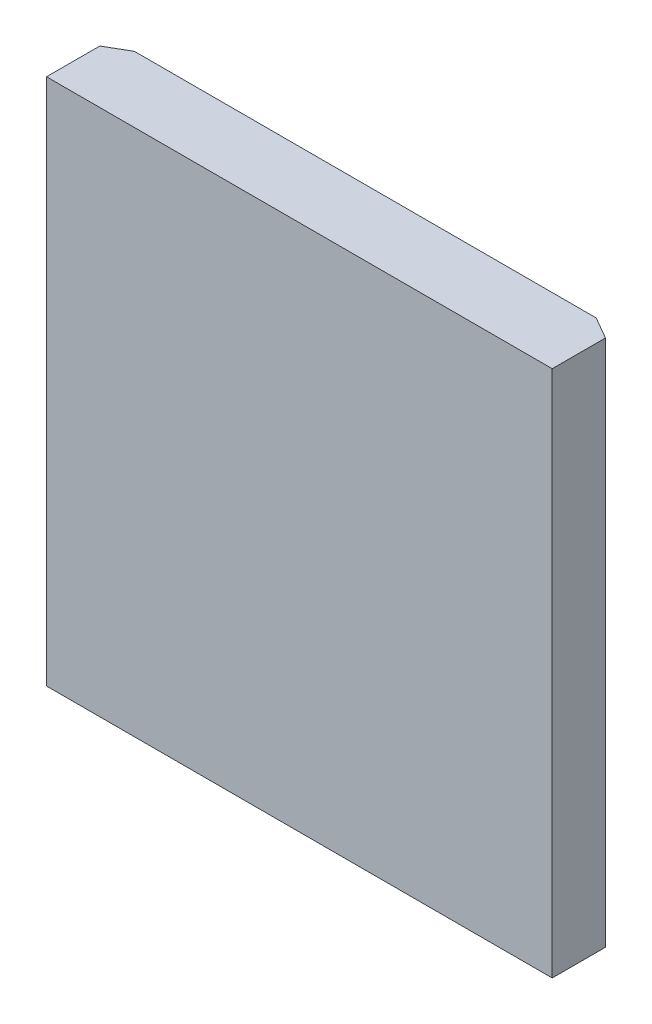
ISO-10303-21;
HEADER;
FILE_DESCRIPTION(('STEP AP214'),'2;1');
FILE_NAME('part.step','',(''),(''),'','','');
FILE_SCHEMA(('AUTOMOTIVE_DESIGN { 1 0 10303 214 1 1 1 1 }'));
ENDSEC;
DATA;
#1=APPLICATION_CONTEXT('core data for automotive mechanical design processes');
#2=APPLICATION_PROTOCOL_DEFINITION('international standard','automotive_design',2000,#1);
#3=PRODUCT_CONTEXT('',#1,'mechanical');
#4=PRODUCT('Part','Part','',(#3));
#5=PRODUCT_RELATED_PRODUCT_CATEGORY('part','',(#4));
#6=PRODUCT_DEFINITION_FORMATION('','',#4);
#7=PRODUCT_DEFINITION_CONTEXT('part definition',#1,'design');
#8=PRODUCT_DEFINITION('design','',#6,#7);
#9=PRODUCT_DEFINITION_SHAPE('','',#8);
#10=(LENGTH_UNIT() NAMED_UNIT(*) SI_UNIT(.MILLI.,.METRE.));
#11=(NAMED_UNIT(*) PLANE_ANGLE_UNIT() SI_UNIT($,.RADIAN.));
#12=(NAMED_UNIT(*) SI_UNIT($,.STERADIAN.) SOLID_ANGLE_UNIT());
#13=UNCERTAINTY_MEASURE_WITH_UNIT(LENGTH_MEASURE(1.E-05),#10,'distance_accuracy_value','');
#14=(GEOMETRIC_REPRESENTATION_CONTEXT(3) GLOBAL_UNCERTAINTY_ASSIGNED_CONTEXT((#13)) GLOBAL_UNIT_ASSIGNED_CONTEXT((#10,
#11,#12)) REPRESENTATION_CONTEXT('',''));
#15=CARTESIAN_POINT('',(0.,0.,0.));
#16=DIRECTION('',(0.,0.,1.));
#17=DIRECTION('',(1.,0.,0.));
#18=AXIS2_PLACEMENT_3D('',#15,#16,#17);
#19=CARTESIAN_POINT('',(146.05,152.4,19.05));
#20=DIRECTION('',(-1.,0.,0.));
#21=DIRECTION('',(0.,0.,1.));
#22=AXIS2_PLACEMENT_3D('',#19,#20,#21);
#23=PLANE('',#22);
#24=DIRECTION('',(0.,0.,-1.));
#25=VECTOR('',#24,1.);
#26=CARTESIAN_POINT('',(146.05,-152.4,19.05));
#27=LINE('',#26,#25);
#28=CARTESIAN_POINT('',(146.05,-152.4,19.05));
#29=VERTEX_POINT('',#28);
#30=CARTESIAN_POINT('',(146.05,-152.4,-11.7176515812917));
#31=VERTEX_POINT('',#30);
#32=EDGE_CURVE('E121',#29,#31,#27,.T.);
#33=ORIENTED_EDGE('',*,*,#32,.T.);
#34=DIRECTION('',(0.,1.,0.));
#35=VECTOR('',#34,1.);
#36=CARTESIAN_POINT('',(146.05,152.4,-11.7176515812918));
#37=LINE('',#36,#35);
#38=CARTESIAN_POINT('',(146.05,152.4,-11.7176515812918));
#39=VERTEX_POINT('',#38);
#40=EDGE_CURVE('E48',#31,#39,#37,.T.);
#41=ORIENTED_EDGE('',*,*,#40,.T.);
#42=DIRECTION('',(0.,0.,-1.));
#43=VECTOR('',#42,1.);
#44=CARTESIAN_POINT('',(146.05,152.4,19.05));
#45=LINE('',#44,#43);
#46=CARTESIAN_POINT('',(146.05,152.4,19.05));
#47=VERTEX_POINT('',#46);
#48=EDGE_CURVE('E127',#47,#39,#45,.T.);
#49=ORIENTED_EDGE('',*,*,#48,.F.);
#50=DIRECTION('',(0.,-1.,0.));
#51=VECTOR('',#50,1.);
#52=CARTESIAN_POINT('',(146.05,152.4,19.05));
#53=LINE('',#52,#51);
#54=EDGE_CURVE('E113',#47,#29,#53,.T.);
#55=ORIENTED_EDGE('',*,*,#54,.T.);
#56=EDGE_LOOP('',(#33,#41,#49,#55));
#57=FACE_BOUND('',#56,.T.);
#58=ADVANCED_FACE('F40',(#57),#23,.F.);
#59=CARTESIAN_POINT('',(-146.05,152.4,-19.05));
#60=DIRECTION('',(0.,0.,1.));
#61=DIRECTION('',(1.,0.,0.));
#62=AXIS2_PLACEMENT_3D('',#59,#60,#61);
#63=PLANE('',#62);
#64=DIRECTION('',(-1.,0.,0.));
#65=VECTOR('',#64,1.);
#66=CARTESIAN_POINT('',(-146.05,152.4,-19.05));
#67=LINE('',#66,#65);
#68=CARTESIAN_POINT('',(133.35,152.4,-19.05));
#69=VERTEX_POINT('',#68);
#70=CARTESIAN_POINT('',(-133.35,152.4,-19.05));
#71=VERTEX_POINT('',#70);
#72=EDGE_CURVE('E103',#69,#71,#67,.T.);
#73=ORIENTED_EDGE('',*,*,#72,.F.);
#74=DIRECTION('',(0.,-1.,0.));
#75=VECTOR('',#74,1.);
#76=CARTESIAN_POINT('',(133.35,152.4,-19.05));
#77=LINE('',#76,#75);
#78=CARTESIAN_POINT('',(133.35,-152.4,-19.05));
#79=VERTEX_POINT('',#78);
#80=EDGE_CURVE('E137',#69,#79,#77,.T.);
#81=ORIENTED_EDGE('',*,*,#80,.T.);
#82=DIRECTION('',(-1.,0.,0.));
#83=VECTOR('',#82,1.);
#84=CARTESIAN_POINT('',(-146.05,-152.4,-19.05));
#85=LINE('',#84,#83);
#86=CARTESIAN_POINT('',(-133.35,-152.4,-19.05));
#87=VERTEX_POINT('',#86);
#88=EDGE_CURVE('E123',#79,#87,#85,.T.);
#89=ORIENTED_EDGE('',*,*,#88,.T.);
#90=DIRECTION('',(0.,1.,0.));
#91=VECTOR('',#90,1.);
#92=CARTESIAN_POINT('',(-133.35,152.4,-19.05));
#93=LINE('',#92,#91);
#94=EDGE_CURVE('E133',#87,#71,#93,.T.);
#95=ORIENTED_EDGE('',*,*,#94,.T.);
#96=EDGE_LOOP('',(#73,#81,#89,#95));
#97=FACE_BOUND('',#96,.T.);
#98=ADVANCED_FACE('F143',(#97),#63,.F.);
#99=CARTESIAN_POINT('',(-146.05,152.4,19.05));
#100=DIRECTION('',(1.,0.,0.));
#101=DIRECTION('',(0.,0.,-1.));
#102=AXIS2_PLACEMENT_3D('',#99,#100,#101);
#103=PLANE('',#102);
#104=DIRECTION('',(0.,0.,1.));
#105=VECTOR('',#104,1.);
#106=CARTESIAN_POINT('',(-146.05,152.4,19.05));
#107=LINE('',#106,#105);
#108=CARTESIAN_POINT('',(-146.05,152.4,-11.7176515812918));
#109=VERTEX_POINT('',#108);
#110=CARTESIAN_POINT('',(-146.05,152.4,19.05));
#111=VERTEX_POINT('',#110);
#112=EDGE_CURVE('E92',#109,#111,#107,.T.);
#113=ORIENTED_EDGE('',*,*,#112,.F.);
#114=DIRECTION('',(0.,-1.,0.));
#115=VECTOR('',#114,1.);
#116=CARTESIAN_POINT('',(-146.05,152.4,-11.7176515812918));
#117=LINE('',#116,#115);
#118=CARTESIAN_POINT('',(-146.05,-152.4,-11.7176515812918));
#119=VERTEX_POINT('',#118);
#120=EDGE_CURVE('E112',#109,#119,#117,.T.);
#121=ORIENTED_EDGE('',*,*,#120,.T.);
#122=DIRECTION('',(0.,0.,1.));
#123=VECTOR('',#122,1.);
#124=CARTESIAN_POINT('',(-146.05,-152.4,19.05));
#125=LINE('',#124,#123);
#126=CARTESIAN_POINT('',(-146.05,-152.4,19.05));
#127=VERTEX_POINT('',#126);
#128=EDGE_CURVE('E109',#119,#127,#125,.T.);
#129=ORIENTED_EDGE('',*,*,#128,.T.);
#130=DIRECTION('',(0.,-1.,0.));
#131=VECTOR('',#130,1.);
#132=CARTESIAN_POINT('',(-146.05,152.4,19.05));
#133=LINE('',#132,#131);
#134=EDGE_CURVE('E106',#111,#127,#133,.T.);
#135=ORIENTED_EDGE('',*,*,#134,.F.);
#136=EDGE_LOOP('',(#113,#121,#129,#135));
#137=FACE_BOUND('',#136,.T.);
#138=ADVANCED_FACE('F107',(#137),#103,.F.);
#139=CARTESIAN_POINT('',(-146.05,152.4,19.05));
#140=DIRECTION('',(0.,0.,-1.));
#141=DIRECTION('',(-1.,0.,0.));
#142=AXIS2_PLACEMENT_3D('',#139,#140,#141);
#143=PLANE('',#142);
#144=DIRECTION('',(1.,0.,0.));
#145=VECTOR('',#144,1.);
#146=CARTESIAN_POINT('',(-146.05,-152.4,19.05));
#147=LINE('',#146,#145);
#148=EDGE_CURVE('E126',#127,#29,#147,.T.);
#149=ORIENTED_EDGE('',*,*,#148,.T.);
#150=ORIENTED_EDGE('',*,*,#54,.F.);
#151=DIRECTION('',(1.,0.,0.));
#152=VECTOR('',#151,1.);
#153=CARTESIAN_POINT('',(-146.05,152.4,19.05));
#154=LINE('',#153,#152);
#155=EDGE_CURVE('E96',#111,#47,#154,.T.);
#156=ORIENTED_EDGE('',*,*,#155,.F.);
#157=ORIENTED_EDGE('',*,*,#134,.T.);
#158=EDGE_LOOP('',(#149,#150,#156,#157));
#159=FACE_BOUND('',#158,.T.);
#160=ADVANCED_FACE('F115',(#159),#143,.F.);
#161=CARTESIAN_POINT('',(146.05,152.4,-19.05));
#162=DIRECTION('',(0.,-1.,0.));
#163=DIRECTION('',(0.,0.,-1.));
#164=AXIS2_PLACEMENT_3D('',#161,#162,#163);
#165=PLANE('',#164);
#166=ORIENTED_EDGE('',*,*,#48,.T.);
#167=DIRECTION('',(0.86602540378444,0.,0.499999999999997));
#168=VECTOR('',#167,1.);
#169=CARTESIAN_POINT('',(133.35,152.4,-19.05));
#170=LINE('',#169,#168);
#171=EDGE_CURVE('E11',#39,#69,#170,.F.);
#172=ORIENTED_EDGE('',*,*,#171,.T.);
#173=ORIENTED_EDGE('',*,*,#72,.T.);
#174=DIRECTION('',(0.86602540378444,0.,-0.499999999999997));
#175=VECTOR('',#174,1.);
#176=CARTESIAN_POINT('',(-146.05,152.4,-11.7176515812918));
#177=LINE('',#176,#175);
#178=EDGE_CURVE('E99',#71,#109,#177,.F.);
#179=ORIENTED_EDGE('',*,*,#178,.T.);
#180=ORIENTED_EDGE('',*,*,#112,.T.);
#181=ORIENTED_EDGE('',*,*,#155,.T.);
#182=EDGE_LOOP('',(#166,#172,#173,#179,#180,#181));
#183=FACE_BOUND('',#182,.T.);
#184=ADVANCED_FACE('F94',(#183),#165,.F.);
#185=CARTESIAN_POINT('',(146.05,-152.4,-19.05));
#186=DIRECTION('',(0.,-1.,0.));
#187=DIRECTION('',(0.,0.,-1.));
#188=AXIS2_PLACEMENT_3D('',#185,#186,#187);
#189=PLANE('',#188);
#190=ORIENTED_EDGE('',*,*,#88,.F.);
#191=DIRECTION('',(-0.86602540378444,0.,-0.499999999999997));
#192=VECTOR('',#191,1.);
#193=CARTESIAN_POINT('',(142.875,-152.4,-13.5507386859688));
#194=LINE('',#193,#192);
#195=EDGE_CURVE('E62',#79,#31,#194,.F.);
#196=ORIENTED_EDGE('',*,*,#195,.T.);
#197=ORIENTED_EDGE('',*,*,#32,.F.);
#198=ORIENTED_EDGE('',*,*,#148,.F.);
#199=ORIENTED_EDGE('',*,*,#128,.F.);
#200=DIRECTION('',(-0.86602540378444,0.,0.499999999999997));
#201=VECTOR('',#200,1.);
#202=CARTESIAN_POINT('',(76.2000000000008,-152.4,-140.033748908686));
#203=LINE('',#202,#201);
#204=EDGE_CURVE('E130',#119,#87,#203,.F.);
#205=ORIENTED_EDGE('',*,*,#204,.T.);
#206=EDGE_LOOP('',(#190,#196,#197,#198,#199,#205));
#207=FACE_BOUND('',#206,.T.);
#208=ADVANCED_FACE('F146',(#207),#189,.T.);
#209=CARTESIAN_POINT('',(-146.05,152.4,-11.7176515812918));
#210=DIRECTION('',(0.499999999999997,0.,0.86602540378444));
#211=DIRECTION('',(0.86602540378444,0.,-0.499999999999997));
#212=AXIS2_PLACEMENT_3D('',#209,#210,#211);
#213=PLANE('',#212);
#214=ORIENTED_EDGE('',*,*,#178,.F.);
#215=ORIENTED_EDGE('',*,*,#94,.F.);
#216=ORIENTED_EDGE('',*,*,#204,.F.);
#217=ORIENTED_EDGE('',*,*,#120,.F.);
#218=EDGE_LOOP('',(#214,#215,#216,#217));
#219=FACE_BOUND('',#218,.T.);
#220=ADVANCED_FACE('F149',(#219),#213,.F.);
#221=CARTESIAN_POINT('',(133.35,152.4,-19.05));
#222=DIRECTION('',(-0.499999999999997,0.,0.86602540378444));
#223=DIRECTION('',(0.86602540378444,0.,0.499999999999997));
#224=AXIS2_PLACEMENT_3D('',#221,#222,#223);
#225=PLANE('',#224);
#226=ORIENTED_EDGE('',*,*,#171,.F.);
#227=ORIENTED_EDGE('',*,*,#40,.F.);
#228=ORIENTED_EDGE('',*,*,#195,.F.);
#229=ORIENTED_EDGE('',*,*,#80,.F.);
#230=EDGE_LOOP('',(#226,#227,#228,#229));
#231=FACE_BOUND('',#230,.T.);
#232=ADVANCED_FACE('F42',(#231),#225,.F.);
#233=CLOSED_SHELL('',(#58,#98,#138,#160,#184,#208,#220,#232));
#234=MANIFOLD_SOLID_BREP('B2',#233);
#235=ADVANCED_BREP_SHAPE_REPRESENTATION('',(#18,#234),#14);
#236=SHAPE_DEFINITION_REPRESENTATION(#9,#235);
ENDSEC;
END-ISO-10303-21;
